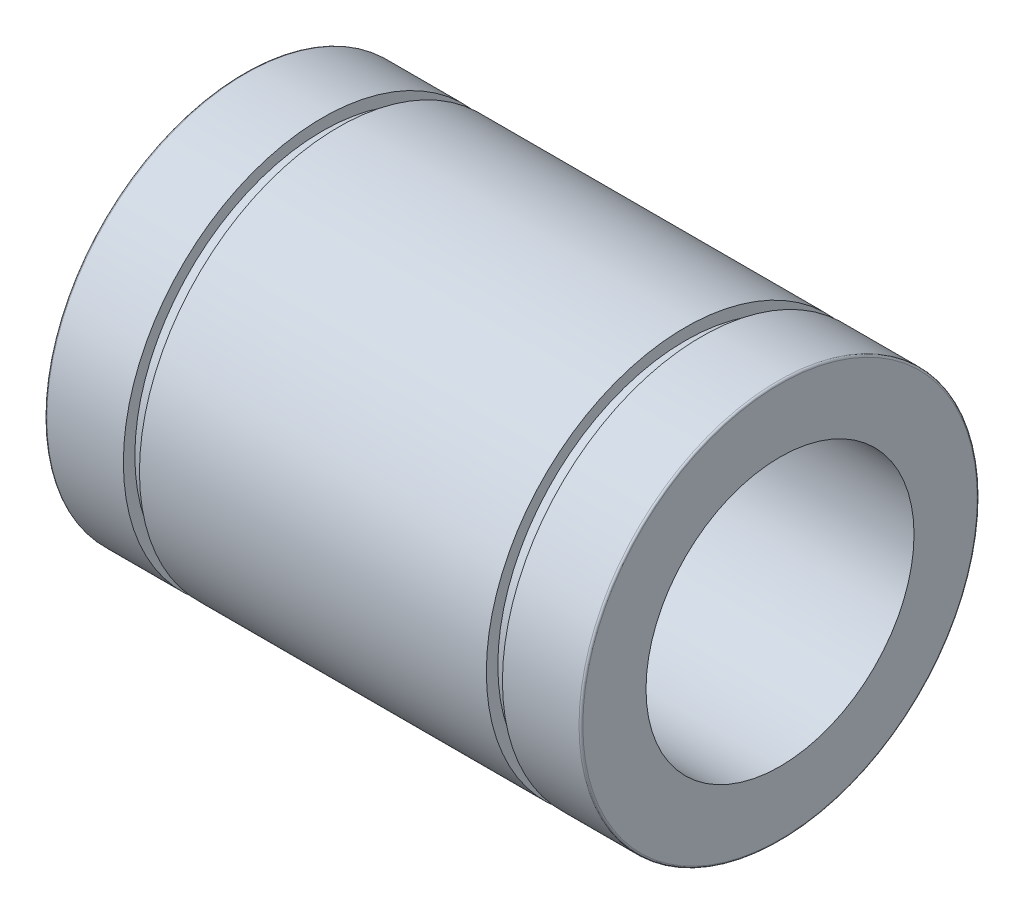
ISO-10303-21;
HEADER;
FILE_DESCRIPTION(('STEP AP214'),'2;1');
FILE_NAME('part.step','',(''),(''),'','','');
FILE_SCHEMA(('AUTOMOTIVE_DESIGN { 1 0 10303 214 1 1 1 1 }'));
ENDSEC;
DATA;
#1=APPLICATION_CONTEXT('core data for automotive mechanical design processes');
#2=APPLICATION_PROTOCOL_DEFINITION('international standard','automotive_design',2000,#1);
#3=PRODUCT_CONTEXT('',#1,'mechanical');
#4=PRODUCT('Part','Part','',(#3));
#5=PRODUCT_RELATED_PRODUCT_CATEGORY('part','',(#4));
#6=PRODUCT_DEFINITION_FORMATION('','',#4);
#7=PRODUCT_DEFINITION_CONTEXT('part definition',#1,'design');
#8=PRODUCT_DEFINITION('design','',#6,#7);
#9=PRODUCT_DEFINITION_SHAPE('','',#8);
#10=(LENGTH_UNIT() NAMED_UNIT(*) SI_UNIT(.MILLI.,.METRE.));
#11=(NAMED_UNIT(*) PLANE_ANGLE_UNIT() SI_UNIT($,.RADIAN.));
#12=(NAMED_UNIT(*) SI_UNIT($,.STERADIAN.) SOLID_ANGLE_UNIT());
#13=UNCERTAINTY_MEASURE_WITH_UNIT(LENGTH_MEASURE(1.E-05),#10,'distance_accuracy_value','');
#14=(GEOMETRIC_REPRESENTATION_CONTEXT(3) GLOBAL_UNCERTAINTY_ASSIGNED_CONTEXT((#13)) GLOBAL_UNIT_ASSIGNED_CONTEXT((#10,
#11,#12)) REPRESENTATION_CONTEXT('',''));
#15=CARTESIAN_POINT('',(0.,0.,0.));
#16=DIRECTION('',(0.,0.,1.));
#17=DIRECTION('',(1.,0.,0.));
#18=AXIS2_PLACEMENT_3D('',#15,#16,#17);
#19=CARTESIAN_POINT('',(-34.75,0.,0.));
#20=DIRECTION('',(1.,0.,0.));
#21=DIRECTION('',(0.,0.,-1.));
#22=AXIS2_PLACEMENT_3D('',#19,#20,#21);
#23=TOROIDAL_SURFACE('',#22,25.75,0.25);
#24=CARTESIAN_POINT('',(-34.75,0.,0.));
#25=DIRECTION('',(1.,0.,0.));
#26=DIRECTION('',(0.,0.,-1.));
#27=AXIS2_PLACEMENT_3D('',#24,#25,#26);
#28=CIRCLE('',#27,26.);
#29=CARTESIAN_POINT('',(-34.75,0.,-26.));
#30=VERTEX_POINT('',#29);
#31=CARTESIAN_POINT('',(-34.75,0.,26.));
#32=VERTEX_POINT('',#31);
#33=EDGE_CURVE('E154',#30,#32,#28,.T.);
#34=ORIENTED_EDGE('',*,*,#33,.F.);
#35=CARTESIAN_POINT('',(-34.75,0.,0.));
#36=DIRECTION('',(1.,0.,0.));
#37=DIRECTION('',(0.,0.,-1.));
#38=AXIS2_PLACEMENT_3D('',#35,#36,#37);
#39=CIRCLE('',#38,26.);
#40=EDGE_CURVE('E160',#32,#30,#39,.T.);
#41=ORIENTED_EDGE('',*,*,#40,.F.);
#42=CARTESIAN_POINT('',(-34.75,0.,25.75));
#43=DIRECTION('',(0.,-1.,0.));
#44=DIRECTION('',(0.,0.,1.));
#45=AXIS2_PLACEMENT_3D('',#42,#43,#44);
#46=CIRCLE('',#45,0.25);
#47=CARTESIAN_POINT('',(-35.,0.,25.75));
#48=VERTEX_POINT('',#47);
#49=EDGE_CURVE('E10',#32,#48,#46,.T.);
#50=ORIENTED_EDGE('',*,*,#49,.T.);
#51=CARTESIAN_POINT('',(-35.,0.,0.));
#52=DIRECTION('',(-1.,0.,0.));
#53=DIRECTION('',(0.,0.,-1.));
#54=AXIS2_PLACEMENT_3D('',#51,#52,#53);
#55=CIRCLE('',#54,25.75);
#56=CARTESIAN_POINT('',(-35.,0.,-25.75));
#57=VERTEX_POINT('',#56);
#58=EDGE_CURVE('E272',#57,#48,#55,.T.);
#59=ORIENTED_EDGE('',*,*,#58,.F.);
#60=CARTESIAN_POINT('',(-35.,0.,0.));
#61=DIRECTION('',(-1.,0.,0.));
#62=DIRECTION('',(0.,0.,-1.));
#63=AXIS2_PLACEMENT_3D('',#60,#61,#62);
#64=CIRCLE('',#63,25.75);
#65=EDGE_CURVE('E43',#48,#57,#64,.T.);
#66=ORIENTED_EDGE('',*,*,#65,.F.);
#67=ORIENTED_EDGE('',*,*,#49,.F.);
#68=EDGE_LOOP('',(#34,#41,#50,#59,#66,#67));
#69=FACE_BOUND('',#68,.T.);
#70=ADVANCED_FACE('F16',(#69),#23,.T.);
#71=CARTESIAN_POINT('',(34.75,0.,0.));
#72=DIRECTION('',(-1.,0.,0.));
#73=DIRECTION('',(0.,0.,1.));
#74=AXIS2_PLACEMENT_3D('',#71,#72,#73);
#75=TOROIDAL_SURFACE('',#74,25.75,0.25);
#76=CARTESIAN_POINT('',(34.75,0.,0.));
#77=DIRECTION('',(-1.,0.,0.));
#78=DIRECTION('',(0.,0.,1.));
#79=AXIS2_PLACEMENT_3D('',#76,#77,#78);
#80=CIRCLE('',#79,26.);
#81=CARTESIAN_POINT('',(34.75,0.,26.));
#82=VERTEX_POINT('',#81);
#83=CARTESIAN_POINT('',(34.75,0.,-26.));
#84=VERTEX_POINT('',#83);
#85=EDGE_CURVE('E176',#82,#84,#80,.T.);
#86=ORIENTED_EDGE('',*,*,#85,.F.);
#87=CARTESIAN_POINT('',(34.75,0.,0.));
#88=DIRECTION('',(-1.,0.,0.));
#89=DIRECTION('',(0.,0.,1.));
#90=AXIS2_PLACEMENT_3D('',#87,#88,#89);
#91=CIRCLE('',#90,26.);
#92=EDGE_CURVE('E172',#84,#82,#91,.T.);
#93=ORIENTED_EDGE('',*,*,#92,.F.);
#94=CARTESIAN_POINT('',(34.75,0.,-25.75));
#95=DIRECTION('',(0.,-1.,0.));
#96=DIRECTION('',(0.,0.,-1.));
#97=AXIS2_PLACEMENT_3D('',#94,#95,#96);
#98=CIRCLE('',#97,0.25);
#99=CARTESIAN_POINT('',(35.,0.,-25.75));
#100=VERTEX_POINT('',#99);
#101=EDGE_CURVE('E25',#84,#100,#98,.T.);
#102=ORIENTED_EDGE('',*,*,#101,.T.);
#103=CARTESIAN_POINT('',(35.,0.,0.));
#104=DIRECTION('',(1.,0.,0.));
#105=DIRECTION('',(0.,0.,1.));
#106=AXIS2_PLACEMENT_3D('',#103,#104,#105);
#107=CIRCLE('',#106,25.75);
#108=CARTESIAN_POINT('',(35.,0.,25.75));
#109=VERTEX_POINT('',#108);
#110=EDGE_CURVE('E247',#109,#100,#107,.T.);
#111=ORIENTED_EDGE('',*,*,#110,.F.);
#112=CARTESIAN_POINT('',(35.,0.,0.));
#113=DIRECTION('',(1.,0.,0.));
#114=DIRECTION('',(0.,0.,1.));
#115=AXIS2_PLACEMENT_3D('',#112,#113,#114);
#116=CIRCLE('',#115,25.75);
#117=EDGE_CURVE('E251',#100,#109,#116,.T.);
#118=ORIENTED_EDGE('',*,*,#117,.F.);
#119=ORIENTED_EDGE('',*,*,#101,.F.);
#120=EDGE_LOOP('',(#86,#93,#102,#111,#118,#119));
#121=FACE_BOUND('',#120,.T.);
#122=ADVANCED_FACE('F283',(#121),#75,.T.);
#123=CARTESIAN_POINT('',(-35.,17.5,0.));
#124=DIRECTION('',(1.,0.,0.));
#125=DIRECTION('',(0.,1.,0.));
#126=AXIS2_PLACEMENT_3D('',#123,#124,#125);
#127=PLANE('',#126);
#128=CARTESIAN_POINT('',(-35.,0.,0.));
#129=DIRECTION('',(-1.,0.,0.));
#130=DIRECTION('',(0.,0.,1.));
#131=AXIS2_PLACEMENT_3D('',#128,#129,#130);
#132=CIRCLE('',#131,17.5);
#133=CARTESIAN_POINT('',(-35.,0.,17.5));
#134=VERTEX_POINT('',#133);
#135=CARTESIAN_POINT('',(-35.,0.,-17.5));
#136=VERTEX_POINT('',#135);
#137=EDGE_CURVE('E269',#134,#136,#132,.T.);
#138=ORIENTED_EDGE('',*,*,#137,.F.);
#139=CARTESIAN_POINT('',(-35.,0.,0.));
#140=DIRECTION('',(-1.,0.,0.));
#141=DIRECTION('',(0.,0.,1.));
#142=AXIS2_PLACEMENT_3D('',#139,#140,#141);
#143=CIRCLE('',#142,17.5);
#144=EDGE_CURVE('E265',#136,#134,#143,.T.);
#145=ORIENTED_EDGE('',*,*,#144,.F.);
#146=EDGE_LOOP('',(#138,#145));
#147=FACE_BOUND('',#146,.T.);
#148=ORIENTED_EDGE('',*,*,#58,.T.);
#149=ORIENTED_EDGE('',*,*,#65,.T.);
#150=EDGE_LOOP('',(#148,#149));
#151=FACE_BOUND('',#150,.T.);
#152=ADVANCED_FACE('F18',(#147,#151),#127,.F.);
#153=CARTESIAN_POINT('',(-70.8336887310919,0.,0.));
#154=DIRECTION('',(-1.,0.,0.));
#155=DIRECTION('',(0.,0.,1.));
#156=AXIS2_PLACEMENT_3D('',#153,#154,#155);
#157=CYLINDRICAL_SURFACE('',#156,17.5);
#158=CARTESIAN_POINT('',(35.,0.,0.));
#159=DIRECTION('',(-1.,0.,0.));
#160=DIRECTION('',(0.,0.,1.));
#161=AXIS2_PLACEMENT_3D('',#158,#159,#160);
#162=CIRCLE('',#161,17.5);
#163=CARTESIAN_POINT('',(35.,0.,17.5));
#164=VERTEX_POINT('',#163);
#165=CARTESIAN_POINT('',(35.,0.,-17.5));
#166=VERTEX_POINT('',#165);
#167=EDGE_CURVE('E254',#164,#166,#162,.T.);
#168=ORIENTED_EDGE('',*,*,#167,.F.);
#169=CARTESIAN_POINT('',(35.,0.,0.));
#170=DIRECTION('',(-1.,0.,0.));
#171=DIRECTION('',(0.,0.,1.));
#172=AXIS2_PLACEMENT_3D('',#169,#170,#171);
#173=CIRCLE('',#172,17.5);
#174=EDGE_CURVE('E258',#166,#164,#173,.T.);
#175=ORIENTED_EDGE('',*,*,#174,.F.);
#176=DIRECTION('',(-1.,0.,0.));
#177=VECTOR('',#176,1.);
#178=CARTESIAN_POINT('',(-70.8336887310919,0.,-17.5));
#179=LINE('',#178,#177);
#180=EDGE_CURVE('E261',#166,#136,#179,.T.);
#181=ORIENTED_EDGE('',*,*,#180,.T.);
#182=ORIENTED_EDGE('',*,*,#144,.T.);
#183=ORIENTED_EDGE('',*,*,#137,.T.);
#184=ORIENTED_EDGE('',*,*,#180,.F.);
#185=EDGE_LOOP('',(#168,#175,#181,#182,#183,#184));
#186=FACE_BOUND('',#185,.T.);
#187=ADVANCED_FACE('F288',(#186),#157,.F.);
#188=CARTESIAN_POINT('',(35.,26.,0.));
#189=DIRECTION('',(-1.,0.,0.));
#190=DIRECTION('',(0.,0.,1.));
#191=AXIS2_PLACEMENT_3D('',#188,#189,#190);
#192=PLANE('',#191);
#193=ORIENTED_EDGE('',*,*,#167,.T.);
#194=ORIENTED_EDGE('',*,*,#174,.T.);
#195=EDGE_LOOP('',(#193,#194));
#196=FACE_BOUND('',#195,.T.);
#197=ORIENTED_EDGE('',*,*,#110,.T.);
#198=ORIENTED_EDGE('',*,*,#117,.T.);
#199=EDGE_LOOP('',(#197,#198));
#200=FACE_BOUND('',#199,.T.);
#201=ADVANCED_FACE('F285',(#196,#200),#192,.F.);
#202=CARTESIAN_POINT('',(-70.8336887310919,0.,0.));
#203=DIRECTION('',(-1.,0.,0.));
#204=DIRECTION('',(0.,0.,1.));
#205=AXIS2_PLACEMENT_3D('',#202,#203,#204);
#206=CYLINDRICAL_SURFACE('',#205,26.);
#207=CARTESIAN_POINT('',(24.75,0.,0.));
#208=DIRECTION('',(-1.,0.,0.));
#209=DIRECTION('',(0.,0.,1.));
#210=AXIS2_PLACEMENT_3D('',#207,#208,#209);
#211=CIRCLE('',#210,26.);
#212=CARTESIAN_POINT('',(24.75,0.,26.));
#213=VERTEX_POINT('',#212);
#214=CARTESIAN_POINT('',(24.75,0.,-26.));
#215=VERTEX_POINT('',#214);
#216=EDGE_CURVE('E234',#213,#215,#211,.T.);
#217=ORIENTED_EDGE('',*,*,#216,.F.);
#218=CARTESIAN_POINT('',(24.75,0.,0.));
#219=DIRECTION('',(-1.,0.,0.));
#220=DIRECTION('',(0.,0.,1.));
#221=AXIS2_PLACEMENT_3D('',#218,#219,#220);
#222=CIRCLE('',#221,26.);
#223=EDGE_CURVE('E238',#215,#213,#222,.T.);
#224=ORIENTED_EDGE('',*,*,#223,.F.);
#225=DIRECTION('',(1.,0.,0.));
#226=VECTOR('',#225,1.);
#227=CARTESIAN_POINT('',(-70.8336887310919,0.,-26.));
#228=LINE('',#227,#226);
#229=EDGE_CURVE('E177',#215,#84,#228,.T.);
#230=ORIENTED_EDGE('',*,*,#229,.T.);
#231=ORIENTED_EDGE('',*,*,#92,.T.);
#232=ORIENTED_EDGE('',*,*,#85,.T.);
#233=ORIENTED_EDGE('',*,*,#229,.F.);
#234=EDGE_LOOP('',(#217,#224,#230,#231,#232,#233));
#235=FACE_BOUND('',#234,.T.);
#236=ADVANCED_FACE('F287',(#235),#206,.T.);
#237=CARTESIAN_POINT('',(24.75,24.5,0.));
#238=DIRECTION('',(1.,0.,0.));
#239=DIRECTION('',(0.,1.,0.));
#240=AXIS2_PLACEMENT_3D('',#237,#238,#239);
#241=PLANE('',#240);
#242=CARTESIAN_POINT('',(24.75,0.,0.));
#243=DIRECTION('',(-1.,0.,0.));
#244=DIRECTION('',(0.,0.,1.));
#245=AXIS2_PLACEMENT_3D('',#242,#243,#244);
#246=CIRCLE('',#245,24.5);
#247=CARTESIAN_POINT('',(24.75,0.,24.5));
#248=VERTEX_POINT('',#247);
#249=CARTESIAN_POINT('',(24.75,0.,-24.5));
#250=VERTEX_POINT('',#249);
#251=EDGE_CURVE('E220',#248,#250,#246,.T.);
#252=ORIENTED_EDGE('',*,*,#251,.F.);
#253=CARTESIAN_POINT('',(24.75,0.,0.));
#254=DIRECTION('',(-1.,0.,0.));
#255=DIRECTION('',(0.,0.,1.));
#256=AXIS2_PLACEMENT_3D('',#253,#254,#255);
#257=CIRCLE('',#256,24.5);
#258=EDGE_CURVE('E216',#250,#248,#257,.T.);
#259=ORIENTED_EDGE('',*,*,#258,.F.);
#260=EDGE_LOOP('',(#252,#259));
#261=FACE_BOUND('',#260,.T.);
#262=ORIENTED_EDGE('',*,*,#216,.T.);
#263=ORIENTED_EDGE('',*,*,#223,.T.);
#264=EDGE_LOOP('',(#262,#263));
#265=FACE_BOUND('',#264,.T.);
#266=ADVANCED_FACE('F295',(#261,#265),#241,.F.);
#267=CARTESIAN_POINT('',(-70.8336887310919,0.,0.));
#268=DIRECTION('',(-1.,0.,0.));
#269=DIRECTION('',(0.,0.,1.));
#270=AXIS2_PLACEMENT_3D('',#267,#268,#269);
#271=CYLINDRICAL_SURFACE('',#270,24.5);
#272=CARTESIAN_POINT('',(22.65,0.,0.));
#273=DIRECTION('',(-1.,0.,0.));
#274=DIRECTION('',(0.,0.,1.));
#275=AXIS2_PLACEMENT_3D('',#272,#273,#274);
#276=CIRCLE('',#275,24.5);
#277=CARTESIAN_POINT('',(22.65,0.,24.5));
#278=VERTEX_POINT('',#277);
#279=CARTESIAN_POINT('',(22.65,0.,-24.5));
#280=VERTEX_POINT('',#279);
#281=EDGE_CURVE('E185',#278,#280,#276,.T.);
#282=ORIENTED_EDGE('',*,*,#281,.F.);
#283=CARTESIAN_POINT('',(22.65,0.,0.));
#284=DIRECTION('',(-1.,0.,0.));
#285=DIRECTION('',(0.,0.,1.));
#286=AXIS2_PLACEMENT_3D('',#283,#284,#285);
#287=CIRCLE('',#286,24.5);
#288=EDGE_CURVE('E189',#280,#278,#287,.T.);
#289=ORIENTED_EDGE('',*,*,#288,.F.);
#290=DIRECTION('',(1.,0.,0.));
#291=VECTOR('',#290,1.);
#292=CARTESIAN_POINT('',(-70.8336887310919,0.,-24.5));
#293=LINE('',#292,#291);
#294=EDGE_CURVE('E221',#280,#250,#293,.T.);
#295=ORIENTED_EDGE('',*,*,#294,.T.);
#296=ORIENTED_EDGE('',*,*,#258,.T.);
#297=ORIENTED_EDGE('',*,*,#251,.T.);
#298=ORIENTED_EDGE('',*,*,#294,.F.);
#299=EDGE_LOOP('',(#282,#289,#295,#296,#297,#298));
#300=FACE_BOUND('',#299,.T.);
#301=ADVANCED_FACE('F316',(#300),#271,.T.);
#302=CARTESIAN_POINT('',(22.65,26.,0.));
#303=DIRECTION('',(-1.,0.,0.));
#304=DIRECTION('',(0.,0.,1.));
#305=AXIS2_PLACEMENT_3D('',#302,#303,#304);
#306=PLANE('',#305);
#307=ORIENTED_EDGE('',*,*,#281,.T.);
#308=ORIENTED_EDGE('',*,*,#288,.T.);
#309=EDGE_LOOP('',(#307,#308));
#310=FACE_BOUND('',#309,.T.);
#311=CARTESIAN_POINT('',(22.65,0.,0.));
#312=DIRECTION('',(-1.,0.,0.));
#313=DIRECTION('',(0.,0.,1.));
#314=AXIS2_PLACEMENT_3D('',#311,#312,#313);
#315=CIRCLE('',#314,26.);
#316=CARTESIAN_POINT('',(22.65,0.,26.));
#317=VERTEX_POINT('',#316);
#318=CARTESIAN_POINT('',(22.65,0.,-26.));
#319=VERTEX_POINT('',#318);
#320=EDGE_CURVE('E190',#317,#319,#315,.T.);
#321=ORIENTED_EDGE('',*,*,#320,.F.);
#322=CARTESIAN_POINT('',(22.65,0.,0.));
#323=DIRECTION('',(-1.,0.,0.));
#324=DIRECTION('',(0.,0.,1.));
#325=AXIS2_PLACEMENT_3D('',#322,#323,#324);
#326=CIRCLE('',#325,26.);
#327=EDGE_CURVE('E215',#319,#317,#326,.T.);
#328=ORIENTED_EDGE('',*,*,#327,.F.);
#329=EDGE_LOOP('',(#321,#328));
#330=FACE_BOUND('',#329,.T.);
#331=ADVANCED_FACE('F312',(#310,#330),#306,.F.);
#332=CARTESIAN_POINT('',(-70.8336887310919,0.,0.));
#333=DIRECTION('',(-1.,0.,0.));
#334=DIRECTION('',(0.,0.,1.));
#335=AXIS2_PLACEMENT_3D('',#332,#333,#334);
#336=CYLINDRICAL_SURFACE('',#335,26.);
#337=CARTESIAN_POINT('',(-22.65,0.,0.));
#338=DIRECTION('',(-1.,0.,0.));
#339=DIRECTION('',(0.,0.,1.));
#340=AXIS2_PLACEMENT_3D('',#337,#338,#339);
#341=CIRCLE('',#340,26.);
#342=CARTESIAN_POINT('',(-22.65,0.,26.));
#343=VERTEX_POINT('',#342);
#344=CARTESIAN_POINT('',(-22.65,0.,-26.));
#345=VERTEX_POINT('',#344);
#346=EDGE_CURVE('E201',#343,#345,#341,.T.);
#347=ORIENTED_EDGE('',*,*,#346,.F.);
#348=CARTESIAN_POINT('',(-22.65,0.,0.));
#349=DIRECTION('',(-1.,0.,0.));
#350=DIRECTION('',(0.,0.,1.));
#351=AXIS2_PLACEMENT_3D('',#348,#349,#350);
#352=CIRCLE('',#351,26.);
#353=EDGE_CURVE('E208',#345,#343,#352,.T.);
#354=ORIENTED_EDGE('',*,*,#353,.F.);
#355=DIRECTION('',(1.,0.,0.));
#356=VECTOR('',#355,1.);
#357=CARTESIAN_POINT('',(-70.8336887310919,0.,-26.));
#358=LINE('',#357,#356);
#359=EDGE_CURVE('E211',#345,#319,#358,.T.);
#360=ORIENTED_EDGE('',*,*,#359,.T.);
#361=ORIENTED_EDGE('',*,*,#327,.T.);
#362=ORIENTED_EDGE('',*,*,#320,.T.);
#363=ORIENTED_EDGE('',*,*,#359,.F.);
#364=EDGE_LOOP('',(#347,#354,#360,#361,#362,#363));
#365=FACE_BOUND('',#364,.T.);
#366=ADVANCED_FACE('F310',(#365),#336,.T.);
#367=CARTESIAN_POINT('',(-22.65,24.5,0.));
#368=DIRECTION('',(1.,0.,0.));
#369=DIRECTION('',(0.,1.,0.));
#370=AXIS2_PLACEMENT_3D('',#367,#368,#369);
#371=PLANE('',#370);
#372=CARTESIAN_POINT('',(-22.65,0.,0.));
#373=DIRECTION('',(-1.,0.,0.));
#374=DIRECTION('',(0.,0.,1.));
#375=AXIS2_PLACEMENT_3D('',#372,#373,#374);
#376=CIRCLE('',#375,24.5);
#377=CARTESIAN_POINT('',(-22.65,0.,24.5));
#378=VERTEX_POINT('',#377);
#379=CARTESIAN_POINT('',(-22.65,0.,-24.5));
#380=VERTEX_POINT('',#379);
#381=EDGE_CURVE('E198',#378,#380,#376,.T.);
#382=ORIENTED_EDGE('',*,*,#381,.F.);
#383=CARTESIAN_POINT('',(-22.65,0.,0.));
#384=DIRECTION('',(-1.,0.,0.));
#385=DIRECTION('',(0.,0.,1.));
#386=AXIS2_PLACEMENT_3D('',#383,#384,#385);
#387=CIRCLE('',#386,24.5);
#388=EDGE_CURVE('E197',#380,#378,#387,.T.);
#389=ORIENTED_EDGE('',*,*,#388,.F.);
#390=EDGE_LOOP('',(#382,#389));
#391=FACE_BOUND('',#390,.T.);
#392=ORIENTED_EDGE('',*,*,#346,.T.);
#393=ORIENTED_EDGE('',*,*,#353,.T.);
#394=EDGE_LOOP('',(#392,#393));
#395=FACE_BOUND('',#394,.T.);
#396=ADVANCED_FACE('F308',(#391,#395),#371,.F.);
#397=CARTESIAN_POINT('',(-70.8336887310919,0.,0.));
#398=DIRECTION('',(-1.,0.,0.));
#399=DIRECTION('',(0.,0.,1.));
#400=AXIS2_PLACEMENT_3D('',#397,#398,#399);
#401=CYLINDRICAL_SURFACE('',#400,24.5);
#402=CARTESIAN_POINT('',(-24.75,0.,0.));
#403=DIRECTION('',(-1.,0.,0.));
#404=DIRECTION('',(0.,0.,1.));
#405=AXIS2_PLACEMENT_3D('',#402,#403,#404);
#406=CIRCLE('',#405,24.5);
#407=CARTESIAN_POINT('',(-24.75,0.,24.5));
#408=VERTEX_POINT('',#407);
#409=CARTESIAN_POINT('',(-24.75,0.,-24.5));
#410=VERTEX_POINT('',#409);
#411=EDGE_CURVE('E180',#408,#410,#406,.T.);
#412=ORIENTED_EDGE('',*,*,#411,.F.);
#413=CARTESIAN_POINT('',(-24.75,0.,0.));
#414=DIRECTION('',(-1.,0.,0.));
#415=DIRECTION('',(0.,0.,1.));
#416=AXIS2_PLACEMENT_3D('',#413,#414,#415);
#417=CIRCLE('',#416,24.5);
#418=EDGE_CURVE('E184',#410,#408,#417,.T.);
#419=ORIENTED_EDGE('',*,*,#418,.F.);
#420=DIRECTION('',(1.,0.,0.));
#421=VECTOR('',#420,1.);
#422=CARTESIAN_POINT('',(-70.8336887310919,0.,-24.5));
#423=LINE('',#422,#421);
#424=EDGE_CURVE('E193',#410,#380,#423,.T.);
#425=ORIENTED_EDGE('',*,*,#424,.T.);
#426=ORIENTED_EDGE('',*,*,#388,.T.);
#427=ORIENTED_EDGE('',*,*,#381,.T.);
#428=ORIENTED_EDGE('',*,*,#424,.F.);
#429=EDGE_LOOP('',(#412,#419,#425,#426,#427,#428));
#430=FACE_BOUND('',#429,.T.);
#431=ADVANCED_FACE('F338',(#430),#401,.T.);
#432=CARTESIAN_POINT('',(-24.75,26.,0.));
#433=DIRECTION('',(-1.,0.,0.));
#434=DIRECTION('',(0.,0.,1.));
#435=AXIS2_PLACEMENT_3D('',#432,#433,#434);
#436=PLANE('',#435);
#437=ORIENTED_EDGE('',*,*,#411,.T.);
#438=ORIENTED_EDGE('',*,*,#418,.T.);
#439=EDGE_LOOP('',(#437,#438));
#440=FACE_BOUND('',#439,.T.);
#441=CARTESIAN_POINT('',(-24.75,0.,0.));
#442=DIRECTION('',(-1.,0.,0.));
#443=DIRECTION('',(0.,0.,1.));
#444=AXIS2_PLACEMENT_3D('',#441,#442,#443);
#445=CIRCLE('',#444,26.);
#446=CARTESIAN_POINT('',(-24.75,0.,26.));
#447=VERTEX_POINT('',#446);
#448=CARTESIAN_POINT('',(-24.75,0.,-26.));
#449=VERTEX_POINT('',#448);
#450=EDGE_CURVE('E156',#447,#449,#445,.T.);
#451=ORIENTED_EDGE('',*,*,#450,.F.);
#452=CARTESIAN_POINT('',(-24.75,0.,0.));
#453=DIRECTION('',(-1.,0.,0.));
#454=DIRECTION('',(0.,0.,1.));
#455=AXIS2_PLACEMENT_3D('',#452,#453,#454);
#456=CIRCLE('',#455,26.);
#457=EDGE_CURVE('E159',#449,#447,#456,.T.);
#458=ORIENTED_EDGE('',*,*,#457,.F.);
#459=EDGE_LOOP('',(#451,#458));
#460=FACE_BOUND('',#459,.T.);
#461=ADVANCED_FACE('F343',(#440,#460),#436,.F.);
#462=CARTESIAN_POINT('',(-70.8336887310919,0.,0.));
#463=DIRECTION('',(-1.,0.,0.));
#464=DIRECTION('',(0.,0.,1.));
#465=AXIS2_PLACEMENT_3D('',#462,#463,#464);
#466=CYLINDRICAL_SURFACE('',#465,26.);
#467=ORIENTED_EDGE('',*,*,#33,.T.);
#468=ORIENTED_EDGE('',*,*,#40,.T.);
#469=DIRECTION('',(1.,0.,0.));
#470=VECTOR('',#469,1.);
#471=CARTESIAN_POINT('',(-70.8336887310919,0.,-26.));
#472=LINE('',#471,#470);
#473=EDGE_CURVE('E150',#30,#449,#472,.T.);
#474=ORIENTED_EDGE('',*,*,#473,.T.);
#475=ORIENTED_EDGE('',*,*,#457,.T.);
#476=ORIENTED_EDGE('',*,*,#450,.T.);
#477=ORIENTED_EDGE('',*,*,#473,.F.);
#478=EDGE_LOOP('',(#467,#468,#474,#475,#476,#477));
#479=FACE_BOUND('',#478,.T.);
#480=ADVANCED_FACE('F152',(#479),#466,.T.);
#481=CLOSED_SHELL('',(#70,#122,#152,#187,#201,#236,#266,#301,#331,#366,#396,#431,#461,#480));
#482=MANIFOLD_SOLID_BREP('B1',#481);
#483=ADVANCED_BREP_SHAPE_REPRESENTATION('',(#18,#482),#14);
#484=SHAPE_DEFINITION_REPRESENTATION(#9,#483);
ENDSEC;
END-ISO-10303-21;
